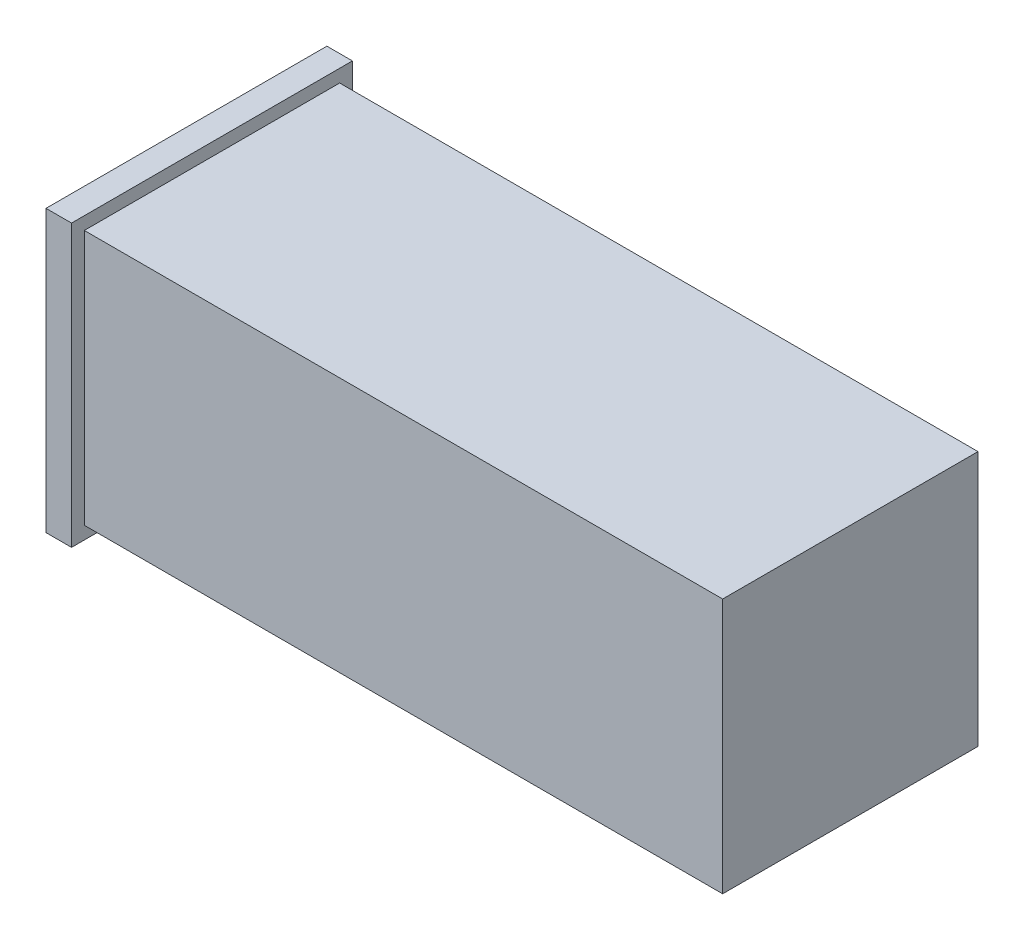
from build123d import *

# Parameters (mm, degrees)
SKETCH1_W           = 250
SKETCH1_H           = 100
BOSS_EXTRUDE1_DEPTH = 100
SKETCH2_W           = 110
SKETCH2_H           = 110
BOSS_EXTRUDE2_DEPTH = 10


with BuildPart() as part:
    # Sketch1 → Boss-Extrude1 (new body)
    with BuildSketch(Plane.XY):
        with Locations((125, 39.003436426)):
            Rectangle(SKETCH1_W, SKETCH1_H)
    extrude(amount=BOSS_EXTRUDE1_DEPTH)

    # Sketch2 → Boss-Extrude2 (add)
    with BuildSketch(Plane.ZY):
        with Locations((50, 39.003436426)):
            Rectangle(SKETCH2_W, SKETCH2_H)
    extrude(amount=BOSS_EXTRUDE2_DEPTH)


solid = part.part
